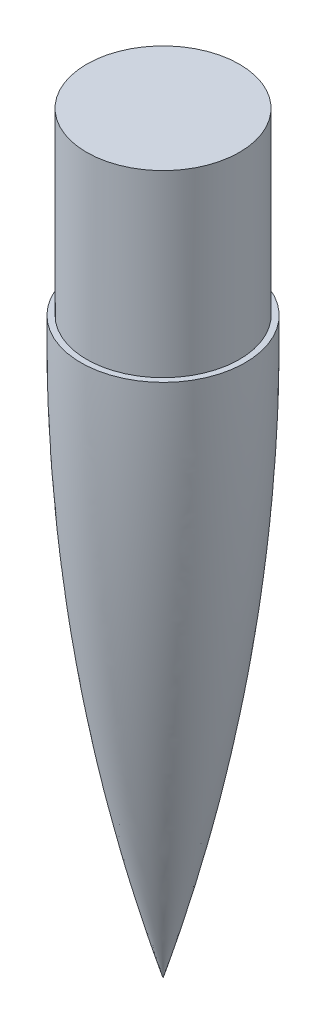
ISO-10303-21;
HEADER;
FILE_DESCRIPTION(('STEP AP214'),'2;1');
FILE_NAME('part.step','',(''),(''),'','','');
FILE_SCHEMA(('AUTOMOTIVE_DESIGN { 1 0 10303 214 1 1 1 1 }'));
ENDSEC;
DATA;
#1=APPLICATION_CONTEXT('core data for automotive mechanical design processes');
#2=APPLICATION_PROTOCOL_DEFINITION('international standard','automotive_design',2000,#1);
#3=PRODUCT_CONTEXT('',#1,'mechanical');
#4=PRODUCT('Part','Part','',(#3));
#5=PRODUCT_RELATED_PRODUCT_CATEGORY('part','',(#4));
#6=PRODUCT_DEFINITION_FORMATION('','',#4);
#7=PRODUCT_DEFINITION_CONTEXT('part definition',#1,'design');
#8=PRODUCT_DEFINITION('design','',#6,#7);
#9=PRODUCT_DEFINITION_SHAPE('','',#8);
#10=(LENGTH_UNIT() NAMED_UNIT(*) SI_UNIT(.MILLI.,.METRE.));
#11=(NAMED_UNIT(*) PLANE_ANGLE_UNIT() SI_UNIT($,.RADIAN.));
#12=(NAMED_UNIT(*) SI_UNIT($,.STERADIAN.) SOLID_ANGLE_UNIT());
#13=UNCERTAINTY_MEASURE_WITH_UNIT(LENGTH_MEASURE(1.E-05),#10,'distance_accuracy_value','');
#14=(GEOMETRIC_REPRESENTATION_CONTEXT(3) GLOBAL_UNCERTAINTY_ASSIGNED_CONTEXT((#13)) GLOBAL_UNIT_ASSIGNED_CONTEXT((#10,
#11,#12)) REPRESENTATION_CONTEXT('',''));
#15=CARTESIAN_POINT('',(0.,0.,0.));
#16=DIRECTION('',(0.,0.,1.));
#17=DIRECTION('',(1.,0.,0.));
#18=AXIS2_PLACEMENT_3D('',#15,#16,#17);
#19=CARTESIAN_POINT('',(0.,203.2,0.));
#20=DIRECTION('',(0.,-1.,0.));
#21=DIRECTION('',(0.,0.,-1.));
#22=AXIS2_PLACEMENT_3D('',#19,#20,#21);
#23=PLANE('',#22);
#24=CARTESIAN_POINT('',(0.,203.2,0.));
#25=DIRECTION('',(0.,-1.,0.));
#26=DIRECTION('',(0.,0.,-1.));
#27=AXIS2_PLACEMENT_3D('',#24,#25,#26);
#28=CIRCLE('',#27,29.083);
#29=CARTESIAN_POINT('',(0.,203.2,-29.083));
#30=VERTEX_POINT('',#29);
#31=EDGE_CURVE('E38',#30,#30,#28,.T.);
#32=ORIENTED_EDGE('',*,*,#31,.F.);
#33=EDGE_LOOP('',(#32));
#34=FACE_BOUND('',#33,.T.);
#35=CARTESIAN_POINT('',(0.,203.2,0.));
#36=DIRECTION('',(0.,-1.,0.));
#37=DIRECTION('',(0.,0.,-1.));
#38=AXIS2_PLACEMENT_3D('',#35,#36,#37);
#39=CIRCLE('',#38,27.051);
#40=CARTESIAN_POINT('',(0.,203.2,-27.051));
#41=VERTEX_POINT('',#40);
#42=EDGE_CURVE('E11',#41,#41,#39,.F.);
#43=ORIENTED_EDGE('',*,*,#42,.F.);
#44=EDGE_LOOP('',(#43));
#45=FACE_BOUND('',#44,.T.);
#46=ADVANCED_FACE('F31',(#34,#45),#23,.F.);
#47=CARTESIAN_POINT('',(0.,197.396764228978,654.780870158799));
#48=DIRECTION('',(-1.,0.,0.));
#49=DIRECTION('',(0.,0.,-1.));
#50=AXIS2_PLACEMENT_3D('',#47,#48,#49);
#51=CIRCLE('',#50,683.888492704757);
#52=TRIMMED_CURVE('',#51,(PARAMETER_VALUE(-0.292804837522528)),
(PARAMETER_VALUE(0.292804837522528)),.T.,.PARAMETER.);
#53=CARTESIAN_POINT('',(0.,197.396764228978,0.));
#54=DIRECTION('',(0.,-1.,0.));
#55=AXIS1_PLACEMENT('',#53,#54);
#56=SURFACE_OF_REVOLUTION('',#52,#55);
#57=CARTESIAN_POINT('',(0.,0.,0.));
#58=VERTEX_POINT('',#57);
#59=VERTEX_LOOP('',#58);
#60=FACE_BOUND('',#59,.T.);
#61=ORIENTED_EDGE('',*,*,#31,.T.);
#62=EDGE_LOOP('',(#61));
#63=FACE_BOUND('',#62,.T.);
#64=ADVANCED_FACE('F33',(#60,#63),#56,.T.);
#65=CARTESIAN_POINT('',(0.,266.7,0.));
#66=DIRECTION('',(0.,-1.,0.));
#67=DIRECTION('',(0.,0.,-1.));
#68=AXIS2_PLACEMENT_3D('',#65,#66,#67);
#69=CYLINDRICAL_SURFACE('',#68,27.051);
#70=CARTESIAN_POINT('',(0.,266.7,0.));
#71=DIRECTION('',(0.,1.,0.));
#72=DIRECTION('',(0.,0.,1.));
#73=AXIS2_PLACEMENT_3D('',#70,#71,#72);
#74=CIRCLE('',#73,27.051);
#75=CARTESIAN_POINT('',(0.,266.7,27.051));
#76=VERTEX_POINT('',#75);
#77=EDGE_CURVE('E47',#76,#76,#74,.T.);
#78=ORIENTED_EDGE('',*,*,#77,.F.);
#79=EDGE_LOOP('',(#78));
#80=FACE_BOUND('',#79,.T.);
#81=ORIENTED_EDGE('',*,*,#42,.T.);
#82=EDGE_LOOP('',(#81));
#83=FACE_BOUND('',#82,.T.);
#84=ADVANCED_FACE('F43',(#80,#83),#69,.T.);
#85=CARTESIAN_POINT('',(0.,266.7,0.));
#86=DIRECTION('',(0.,1.,0.));
#87=DIRECTION('',(0.,0.,1.));
#88=AXIS2_PLACEMENT_3D('',#85,#86,#87);
#89=PLANE('',#88);
#90=ORIENTED_EDGE('',*,*,#77,.T.);
#91=EDGE_LOOP('',(#90));
#92=FACE_BOUND('',#91,.T.);
#93=ADVANCED_FACE('F52',(#92),#89,.T.);
#94=CLOSED_SHELL('',(#46,#64,#84,#93));
#95=MANIFOLD_SOLID_BREP('B2',#94);
#96=ADVANCED_BREP_SHAPE_REPRESENTATION('',(#18,#95),#14);
#97=SHAPE_DEFINITION_REPRESENTATION(#9,#96);
ENDSEC;
END-ISO-10303-21;
